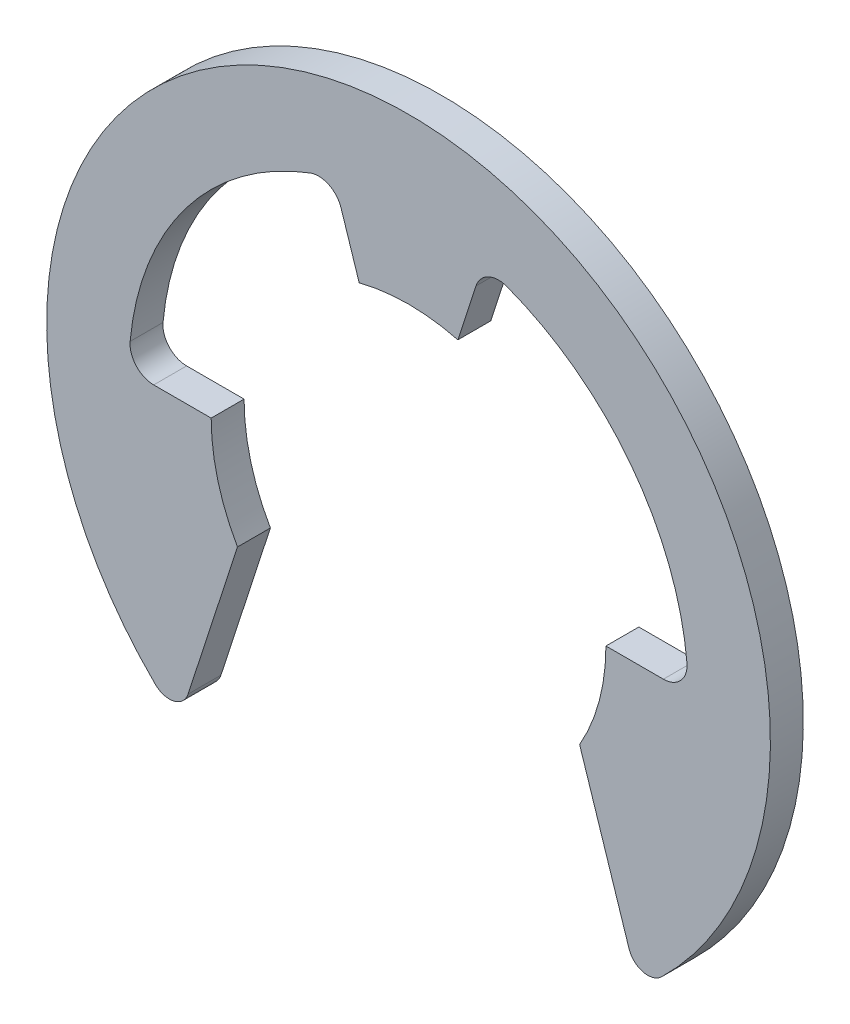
ISO-10303-21;
HEADER;
FILE_DESCRIPTION(('STEP AP214'),'2;1');
FILE_NAME('part.step','',(''),(''),'','','');
FILE_SCHEMA(('AUTOMOTIVE_DESIGN { 1 0 10303 214 1 1 1 1 }'));
ENDSEC;
DATA;
#1=APPLICATION_CONTEXT('core data for automotive mechanical design processes');
#2=APPLICATION_PROTOCOL_DEFINITION('international standard','automotive_design',2000,#1);
#3=PRODUCT_CONTEXT('',#1,'mechanical');
#4=PRODUCT('Part','Part','',(#3));
#5=PRODUCT_RELATED_PRODUCT_CATEGORY('part','',(#4));
#6=PRODUCT_DEFINITION_FORMATION('','',#4);
#7=PRODUCT_DEFINITION_CONTEXT('part definition',#1,'design');
#8=PRODUCT_DEFINITION('design','',#6,#7);
#9=PRODUCT_DEFINITION_SHAPE('','',#8);
#10=(LENGTH_UNIT() NAMED_UNIT(*) SI_UNIT(.MILLI.,.METRE.));
#11=(NAMED_UNIT(*) PLANE_ANGLE_UNIT() SI_UNIT($,.RADIAN.));
#12=(NAMED_UNIT(*) SI_UNIT($,.STERADIAN.) SOLID_ANGLE_UNIT());
#13=UNCERTAINTY_MEASURE_WITH_UNIT(LENGTH_MEASURE(1.E-05),#10,'distance_accuracy_value','');
#14=(GEOMETRIC_REPRESENTATION_CONTEXT(3) GLOBAL_UNCERTAINTY_ASSIGNED_CONTEXT((#13)) GLOBAL_UNIT_ASSIGNED_CONTEXT((#10,
#11,#12)) REPRESENTATION_CONTEXT('',''));
#15=CARTESIAN_POINT('',(0.,0.,0.));
#16=DIRECTION('',(0.,0.,1.));
#17=DIRECTION('',(1.,0.,0.));
#18=AXIS2_PLACEMENT_3D('',#15,#16,#17);
#19=CARTESIAN_POINT('',(-14.5470933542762,-14.8668111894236,2.));
#20=DIRECTION('',(0.,0.,-1.));
#21=DIRECTION('',(-1.,0.,0.));
#22=AXIS2_PLACEMENT_3D('',#19,#20,#21);
#23=CYLINDRICAL_SURFACE('',#22,1.2);
#24=CARTESIAN_POINT('',(-14.5470933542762,-14.8668111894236,0.));
#25=DIRECTION('',(0.,0.,1.));
#26=DIRECTION('',(-1.,0.,0.));
#27=AXIS2_PLACEMENT_3D('',#24,#25,#26);
#28=CIRCLE('',#27,1.2);
#29=CARTESIAN_POINT('',(-15.3863487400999,-15.7245118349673,0.));
#30=VERTEX_POINT('',#29);
#31=CARTESIAN_POINT('',(-13.4058255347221,-15.2376315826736,0.));
#32=VERTEX_POINT('',#31);
#33=EDGE_CURVE('E181',#30,#32,#28,.T.);
#34=ORIENTED_EDGE('',*,*,#33,.T.);
#35=DIRECTION('',(0.,0.,-1.));
#36=VECTOR('',#35,1.);
#37=CARTESIAN_POINT('',(-13.4058255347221,-15.2376315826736,2.));
#38=LINE('',#37,#36);
#39=CARTESIAN_POINT('',(-13.4058255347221,-15.2376315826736,2.));
#40=VERTEX_POINT('',#39);
#41=EDGE_CURVE('E162',#40,#32,#38,.T.);
#42=ORIENTED_EDGE('',*,*,#41,.F.);
#43=CARTESIAN_POINT('',(-14.5470933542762,-14.8668111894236,2.));
#44=DIRECTION('',(0.,0.,1.));
#45=DIRECTION('',(-1.,0.,0.));
#46=AXIS2_PLACEMENT_3D('',#43,#44,#45);
#47=CIRCLE('',#46,1.2);
#48=CARTESIAN_POINT('',(-15.3863487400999,-15.7245118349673,2.));
#49=VERTEX_POINT('',#48);
#50=EDGE_CURVE('E169',#49,#40,#47,.T.);
#51=ORIENTED_EDGE('',*,*,#50,.F.);
#52=DIRECTION('',(0.,0.,-1.));
#53=VECTOR('',#52,1.);
#54=CARTESIAN_POINT('',(-15.3863487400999,-15.7245118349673,2.));
#55=LINE('',#54,#53);
#56=EDGE_CURVE('E268',#49,#30,#55,.T.);
#57=ORIENTED_EDGE('',*,*,#56,.T.);
#58=EDGE_LOOP('',(#34,#42,#51,#57));
#59=FACE_BOUND('',#58,.T.);
#60=ADVANCED_FACE('F33',(#59),#23,.T.);
#61=CARTESIAN_POINT('',(-10.4,-5.98665181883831,2.));
#62=DIRECTION('',(-0.951056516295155,0.309016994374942,0.));
#63=DIRECTION('',(-0.309016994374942,-0.951056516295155,0.));
#64=AXIS2_PLACEMENT_3D('',#61,#62,#63);
#65=PLANE('',#64);
#66=DIRECTION('',(0.309016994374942,0.951056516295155,0.));
#67=VECTOR('',#66,1.);
#68=CARTESIAN_POINT('',(-10.4,-5.98665181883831,0.));
#69=LINE('',#68,#67);
#70=CARTESIAN_POINT('',(-10.4,-5.98665181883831,0.));
#71=VERTEX_POINT('',#70);
#72=EDGE_CURVE('E291',#32,#71,#69,.T.);
#73=ORIENTED_EDGE('',*,*,#72,.T.);
#74=DIRECTION('',(0.,0.,-1.));
#75=VECTOR('',#74,1.);
#76=CARTESIAN_POINT('',(-10.4,-5.98665181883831,2.));
#77=LINE('',#76,#75);
#78=CARTESIAN_POINT('',(-10.4,-5.98665181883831,2.));
#79=VERTEX_POINT('',#78);
#80=EDGE_CURVE('E165',#79,#71,#77,.T.);
#81=ORIENTED_EDGE('',*,*,#80,.F.);
#82=DIRECTION('',(0.309016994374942,0.951056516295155,0.));
#83=VECTOR('',#82,1.);
#84=CARTESIAN_POINT('',(-10.4,-5.98665181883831,2.));
#85=LINE('',#84,#83);
#86=EDGE_CURVE('E158',#40,#79,#85,.T.);
#87=ORIENTED_EDGE('',*,*,#86,.F.);
#88=ORIENTED_EDGE('',*,*,#41,.T.);
#89=EDGE_LOOP('',(#73,#81,#87,#88));
#90=FACE_BOUND('',#89,.T.);
#91=ADVANCED_FACE('F160',(#90),#65,.F.);
#92=CARTESIAN_POINT('',(0.,0.,2.));
#93=DIRECTION('',(0.,0.,-1.));
#94=DIRECTION('',(-1.,0.,0.));
#95=AXIS2_PLACEMENT_3D('',#92,#93,#94);
#96=CYLINDRICAL_SURFACE('',#95,12.);
#97=CARTESIAN_POINT('',(0.,0.,0.));
#98=DIRECTION('',(0.,0.,-1.));
#99=DIRECTION('',(1.,0.,0.));
#100=AXIS2_PLACEMENT_3D('',#97,#98,#99);
#101=CIRCLE('',#100,12.);
#102=CARTESIAN_POINT('',(-12.,0.,0.));
#103=VERTEX_POINT('',#102);
#104=EDGE_CURVE('E248',#71,#103,#101,.T.);
#105=ORIENTED_EDGE('',*,*,#104,.T.);
#106=DIRECTION('',(0.,0.,-1.));
#107=VECTOR('',#106,1.);
#108=CARTESIAN_POINT('',(-12.,0.,2.));
#109=LINE('',#108,#107);
#110=CARTESIAN_POINT('',(-12.,0.,2.));
#111=VERTEX_POINT('',#110);
#112=EDGE_CURVE('E187',#111,#103,#109,.T.);
#113=ORIENTED_EDGE('',*,*,#112,.F.);
#114=CARTESIAN_POINT('',(0.,0.,2.));
#115=DIRECTION('',(0.,0.,-1.));
#116=DIRECTION('',(1.,0.,0.));
#117=AXIS2_PLACEMENT_3D('',#114,#115,#116);
#118=CIRCLE('',#117,12.);
#119=EDGE_CURVE('E168',#79,#111,#118,.T.);
#120=ORIENTED_EDGE('',*,*,#119,.F.);
#121=ORIENTED_EDGE('',*,*,#80,.T.);
#122=EDGE_LOOP('',(#105,#113,#120,#121));
#123=FACE_BOUND('',#122,.T.);
#124=ADVANCED_FACE('F314',(#123),#96,.F.);
#125=CARTESIAN_POINT('',(-12.,0.,2.));
#126=DIRECTION('',(0.,-1.,0.));
#127=DIRECTION('',(0.,0.,-1.));
#128=AXIS2_PLACEMENT_3D('',#125,#126,#127);
#129=PLANE('',#128);
#130=DIRECTION('',(-1.,0.,0.));
#131=VECTOR('',#130,1.);
#132=CARTESIAN_POINT('',(-12.,0.,0.));
#133=LINE('',#132,#131);
#134=CARTESIAN_POINT('',(-15.4932243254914,0.,0.));
#135=VERTEX_POINT('',#134);
#136=EDGE_CURVE('E244',#103,#135,#133,.T.);
#137=ORIENTED_EDGE('',*,*,#136,.T.);
#138=DIRECTION('',(0.,0.,1.));
#139=VECTOR('',#138,1.);
#140=CARTESIAN_POINT('',(-15.4932243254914,0.,2.));
#141=LINE('',#140,#139);
#142=CARTESIAN_POINT('',(-15.4932243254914,0.,2.));
#143=VERTEX_POINT('',#142);
#144=EDGE_CURVE('E48',#135,#143,#141,.T.);
#145=ORIENTED_EDGE('',*,*,#144,.T.);
#146=DIRECTION('',(-1.,0.,0.));
#147=VECTOR('',#146,1.);
#148=CARTESIAN_POINT('',(-12.,0.,2.));
#149=LINE('',#148,#147);
#150=EDGE_CURVE('E288',#111,#143,#149,.T.);
#151=ORIENTED_EDGE('',*,*,#150,.F.);
#152=ORIENTED_EDGE('',*,*,#112,.T.);
#153=EDGE_LOOP('',(#137,#145,#151,#152));
#154=FACE_BOUND('',#153,.T.);
#155=ADVANCED_FACE('F287',(#154),#129,.F.);
#156=CARTESIAN_POINT('',(0.,0.,2.));
#157=DIRECTION('',(0.,0.,-1.));
#158=DIRECTION('',(-1.,0.,0.));
#159=AXIS2_PLACEMENT_3D('',#156,#157,#158);
#160=CYLINDRICAL_SURFACE('',#159,17.);
#161=CARTESIAN_POINT('',(0.,0.,0.));
#162=DIRECTION('',(0.,0.,-1.));
#163=DIRECTION('',(1.,0.,0.));
#164=AXIS2_PLACEMENT_3D('',#161,#162,#163);
#165=CIRCLE('',#164,17.);
#166=CARTESIAN_POINT('',(-16.9270445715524,1.573264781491,0.));
#167=VERTEX_POINT('',#166);
#168=CARTESIAN_POINT('',(-5.97810200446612,15.9142168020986,0.));
#169=VERTEX_POINT('',#168);
#170=EDGE_CURVE('E238',#167,#169,#165,.T.);
#171=ORIENTED_EDGE('',*,*,#170,.T.);
#172=DIRECTION('',(0.,0.,-1.));
#173=VECTOR('',#172,1.);
#174=CARTESIAN_POINT('',(-5.97810200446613,15.9142168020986,2.));
#175=LINE('',#174,#173);
#176=CARTESIAN_POINT('',(-5.97810200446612,15.9142168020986,2.));
#177=VERTEX_POINT('',#176);
#178=EDGE_CURVE('E203',#169,#177,#175,.F.);
#179=ORIENTED_EDGE('',*,*,#178,.T.);
#180=CARTESIAN_POINT('',(0.,0.,2.));
#181=DIRECTION('',(0.,0.,-1.));
#182=DIRECTION('',(1.,0.,0.));
#183=AXIS2_PLACEMENT_3D('',#180,#181,#182);
#184=CIRCLE('',#183,17.);
#185=CARTESIAN_POINT('',(-16.9270445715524,1.573264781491,2.));
#186=VERTEX_POINT('',#185);
#187=EDGE_CURVE('E223',#186,#177,#184,.T.);
#188=ORIENTED_EDGE('',*,*,#187,.F.);
#189=DIRECTION('',(0.,0.,-1.));
#190=VECTOR('',#189,1.);
#191=CARTESIAN_POINT('',(-16.9270445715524,1.573264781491,2.));
#192=LINE('',#191,#190);
#193=EDGE_CURVE('E200',#186,#167,#192,.T.);
#194=ORIENTED_EDGE('',*,*,#193,.T.);
#195=EDGE_LOOP('',(#171,#179,#188,#194));
#196=FACE_BOUND('',#195,.T.);
#197=ADVANCED_FACE('F242',(#196),#160,.F.);
#198=CARTESIAN_POINT('',(-3.,11.6189500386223,2.));
#199=DIRECTION('',(0.951056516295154,0.309016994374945,0.));
#200=DIRECTION('',(-0.309016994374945,0.951056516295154,0.));
#201=AXIS2_PLACEMENT_3D('',#198,#199,#200);
#202=PLANE('',#201);
#203=DIRECTION('',(0.309016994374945,-0.951056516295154,0.));
#204=VECTOR('',#203,1.);
#205=CARTESIAN_POINT('',(-3.,11.6189500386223,2.));
#206=LINE('',#205,#204);
#207=CARTESIAN_POINT('',(-4.10220021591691,15.0111734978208,2.));
#208=VERTEX_POINT('',#207);
#209=CARTESIAN_POINT('',(-3.,11.6189500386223,2.));
#210=VERTEX_POINT('',#209);
#211=EDGE_CURVE('E220',#208,#210,#206,.T.);
#212=ORIENTED_EDGE('',*,*,#211,.F.);
#213=DIRECTION('',(0.,0.,1.));
#214=VECTOR('',#213,1.);
#215=CARTESIAN_POINT('',(-4.10220021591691,15.0111734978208,0.));
#216=LINE('',#215,#214);
#217=CARTESIAN_POINT('',(-4.10220021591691,15.0111734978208,0.));
#218=VERTEX_POINT('',#217);
#219=EDGE_CURVE('E197',#208,#218,#216,.F.);
#220=ORIENTED_EDGE('',*,*,#219,.T.);
#221=DIRECTION('',(0.309016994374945,-0.951056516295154,0.));
#222=VECTOR('',#221,1.);
#223=CARTESIAN_POINT('',(-3.,11.6189500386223,0.));
#224=LINE('',#223,#222);
#225=CARTESIAN_POINT('',(-3.,11.6189500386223,0.));
#226=VERTEX_POINT('',#225);
#227=EDGE_CURVE('E240',#218,#226,#224,.T.);
#228=ORIENTED_EDGE('',*,*,#227,.T.);
#229=DIRECTION('',(0.,0.,-1.));
#230=VECTOR('',#229,1.);
#231=CARTESIAN_POINT('',(-3.,11.6189500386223,2.));
#232=LINE('',#231,#230);
#233=EDGE_CURVE('E231',#210,#226,#232,.T.);
#234=ORIENTED_EDGE('',*,*,#233,.F.);
#235=EDGE_LOOP('',(#212,#220,#228,#234));
#236=FACE_BOUND('',#235,.T.);
#237=ADVANCED_FACE('F228',(#236),#202,.F.);
#238=CARTESIAN_POINT('',(0.,0.,2.));
#239=DIRECTION('',(0.,0.,-1.));
#240=DIRECTION('',(-1.,0.,0.));
#241=AXIS2_PLACEMENT_3D('',#238,#239,#240);
#242=CYLINDRICAL_SURFACE('',#241,12.);
#243=CARTESIAN_POINT('',(0.,0.,0.));
#244=DIRECTION('',(0.,0.,-1.));
#245=DIRECTION('',(1.,0.,0.));
#246=AXIS2_PLACEMENT_3D('',#243,#244,#245);
#247=CIRCLE('',#246,12.);
#248=CARTESIAN_POINT('',(3.,11.6189500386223,0.));
#249=VERTEX_POINT('',#248);
#250=EDGE_CURVE('E246',#226,#249,#247,.T.);
#251=ORIENTED_EDGE('',*,*,#250,.T.);
#252=DIRECTION('',(0.,0.,-1.));
#253=VECTOR('',#252,1.);
#254=CARTESIAN_POINT('',(3.,11.6189500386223,2.));
#255=LINE('',#254,#253);
#256=CARTESIAN_POINT('',(3.,11.6189500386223,2.));
#257=VERTEX_POINT('',#256);
#258=EDGE_CURVE('E282',#257,#249,#255,.T.);
#259=ORIENTED_EDGE('',*,*,#258,.F.);
#260=CARTESIAN_POINT('',(0.,0.,2.));
#261=DIRECTION('',(0.,0.,-1.));
#262=DIRECTION('',(1.,0.,0.));
#263=AXIS2_PLACEMENT_3D('',#260,#261,#262);
#264=CIRCLE('',#263,12.);
#265=EDGE_CURVE('E233',#210,#257,#264,.T.);
#266=ORIENTED_EDGE('',*,*,#265,.F.);
#267=ORIENTED_EDGE('',*,*,#233,.T.);
#268=EDGE_LOOP('',(#251,#259,#266,#267));
#269=FACE_BOUND('',#268,.T.);
#270=ADVANCED_FACE('F410',(#269),#242,.F.);
#271=CARTESIAN_POINT('',(3.,11.6189500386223,2.));
#272=DIRECTION('',(-0.951056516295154,0.309016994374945,0.));
#273=DIRECTION('',(-0.309016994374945,-0.951056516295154,0.));
#274=AXIS2_PLACEMENT_3D('',#271,#272,#273);
#275=PLANE('',#274);
#276=DIRECTION('',(0.309016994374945,0.951056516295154,0.));
#277=VECTOR('',#276,1.);
#278=CARTESIAN_POINT('',(3.,11.6189500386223,0.));
#279=LINE('',#278,#277);
#280=CARTESIAN_POINT('',(4.10220021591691,15.0111734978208,0.));
#281=VERTEX_POINT('',#280);
#282=EDGE_CURVE('E253',#249,#281,#279,.T.);
#283=ORIENTED_EDGE('',*,*,#282,.T.);
#284=DIRECTION('',(0.,0.,1.));
#285=VECTOR('',#284,1.);
#286=CARTESIAN_POINT('',(4.10220021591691,15.0111734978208,2.));
#287=LINE('',#286,#285);
#288=CARTESIAN_POINT('',(4.10220021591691,15.0111734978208,2.));
#289=VERTEX_POINT('',#288);
#290=EDGE_CURVE('E195',#281,#289,#287,.T.);
#291=ORIENTED_EDGE('',*,*,#290,.T.);
#292=DIRECTION('',(0.309016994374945,0.951056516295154,0.));
#293=VECTOR('',#292,1.);
#294=CARTESIAN_POINT('',(3.,11.6189500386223,2.));
#295=LINE('',#294,#293);
#296=EDGE_CURVE('E307',#257,#289,#295,.T.);
#297=ORIENTED_EDGE('',*,*,#296,.F.);
#298=ORIENTED_EDGE('',*,*,#258,.T.);
#299=EDGE_LOOP('',(#283,#291,#297,#298));
#300=FACE_BOUND('',#299,.T.);
#301=ADVANCED_FACE('F400',(#300),#275,.F.);
#302=CARTESIAN_POINT('',(0.,0.,2.));
#303=DIRECTION('',(0.,0.,-1.));
#304=DIRECTION('',(-1.,0.,0.));
#305=AXIS2_PLACEMENT_3D('',#302,#303,#304);
#306=CYLINDRICAL_SURFACE('',#305,17.);
#307=CARTESIAN_POINT('',(0.,0.,0.));
#308=DIRECTION('',(0.,0.,-1.));
#309=DIRECTION('',(1.,0.,0.));
#310=AXIS2_PLACEMENT_3D('',#307,#308,#309);
#311=CIRCLE('',#310,17.);
#312=CARTESIAN_POINT('',(5.97810200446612,15.9142168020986,0.));
#313=VERTEX_POINT('',#312);
#314=CARTESIAN_POINT('',(16.9270445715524,1.573264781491,0.));
#315=VERTEX_POINT('',#314);
#316=EDGE_CURVE('E256',#313,#315,#311,.T.);
#317=ORIENTED_EDGE('',*,*,#316,.T.);
#318=DIRECTION('',(0.,0.,-1.));
#319=VECTOR('',#318,1.);
#320=CARTESIAN_POINT('',(16.9270445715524,1.573264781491,2.));
#321=LINE('',#320,#319);
#322=CARTESIAN_POINT('',(16.9270445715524,1.573264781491,2.));
#323=VERTEX_POINT('',#322);
#324=EDGE_CURVE('E193',#315,#323,#321,.F.);
#325=ORIENTED_EDGE('',*,*,#324,.T.);
#326=CARTESIAN_POINT('',(0.,0.,2.));
#327=DIRECTION('',(0.,0.,-1.));
#328=DIRECTION('',(1.,0.,0.));
#329=AXIS2_PLACEMENT_3D('',#326,#327,#328);
#330=CIRCLE('',#329,17.);
#331=CARTESIAN_POINT('',(5.97810200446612,15.9142168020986,2.));
#332=VERTEX_POINT('',#331);
#333=EDGE_CURVE('E304',#332,#323,#330,.T.);
#334=ORIENTED_EDGE('',*,*,#333,.F.);
#335=DIRECTION('',(0.,0.,-1.));
#336=VECTOR('',#335,1.);
#337=CARTESIAN_POINT('',(5.97810200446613,15.9142168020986,2.));
#338=LINE('',#337,#336);
#339=EDGE_CURVE('E185',#332,#313,#338,.T.);
#340=ORIENTED_EDGE('',*,*,#339,.T.);
#341=EDGE_LOOP('',(#317,#325,#334,#340));
#342=FACE_BOUND('',#341,.T.);
#343=ADVANCED_FACE('F388',(#342),#306,.F.);
#344=CARTESIAN_POINT('',(12.,0.,2.));
#345=DIRECTION('',(0.,-1.,0.));
#346=DIRECTION('',(0.,0.,-1.));
#347=AXIS2_PLACEMENT_3D('',#344,#345,#346);
#348=PLANE('',#347);
#349=DIRECTION('',(-1.,0.,0.));
#350=VECTOR('',#349,1.);
#351=CARTESIAN_POINT('',(12.,0.,2.));
#352=LINE('',#351,#350);
#353=CARTESIAN_POINT('',(15.4932243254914,0.,2.));
#354=VERTEX_POINT('',#353);
#355=CARTESIAN_POINT('',(12.,0.,2.));
#356=VERTEX_POINT('',#355);
#357=EDGE_CURVE('E302',#354,#356,#352,.T.);
#358=ORIENTED_EDGE('',*,*,#357,.F.);
#359=DIRECTION('',(0.,0.,1.));
#360=VECTOR('',#359,1.);
#361=CARTESIAN_POINT('',(15.4932243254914,0.,0.));
#362=LINE('',#361,#360);
#363=CARTESIAN_POINT('',(15.4932243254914,0.,0.));
#364=VERTEX_POINT('',#363);
#365=EDGE_CURVE('E182',#354,#364,#362,.F.);
#366=ORIENTED_EDGE('',*,*,#365,.T.);
#367=DIRECTION('',(-1.,0.,0.));
#368=VECTOR('',#367,1.);
#369=CARTESIAN_POINT('',(12.,0.,0.));
#370=LINE('',#369,#368);
#371=CARTESIAN_POINT('',(12.,0.,0.));
#372=VERTEX_POINT('',#371);
#373=EDGE_CURVE('E259',#364,#372,#370,.T.);
#374=ORIENTED_EDGE('',*,*,#373,.T.);
#375=DIRECTION('',(0.,0.,-1.));
#376=VECTOR('',#375,1.);
#377=CARTESIAN_POINT('',(12.,0.,2.));
#378=LINE('',#377,#376);
#379=EDGE_CURVE('E279',#356,#372,#378,.T.);
#380=ORIENTED_EDGE('',*,*,#379,.F.);
#381=EDGE_LOOP('',(#358,#366,#374,#380));
#382=FACE_BOUND('',#381,.T.);
#383=ADVANCED_FACE('F382',(#382),#348,.F.);
#384=CARTESIAN_POINT('',(0.,0.,2.));
#385=DIRECTION('',(0.,0.,-1.));
#386=DIRECTION('',(-1.,0.,0.));
#387=AXIS2_PLACEMENT_3D('',#384,#385,#386);
#388=CYLINDRICAL_SURFACE('',#387,12.);
#389=CARTESIAN_POINT('',(0.,0.,0.));
#390=DIRECTION('',(0.,0.,-1.));
#391=DIRECTION('',(1.,0.,0.));
#392=AXIS2_PLACEMENT_3D('',#389,#390,#391);
#393=CIRCLE('',#392,12.);
#394=CARTESIAN_POINT('',(10.4,-5.98665181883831,0.));
#395=VERTEX_POINT('',#394);
#396=EDGE_CURVE('E261',#372,#395,#393,.T.);
#397=ORIENTED_EDGE('',*,*,#396,.T.);
#398=DIRECTION('',(0.,0.,-1.));
#399=VECTOR('',#398,1.);
#400=CARTESIAN_POINT('',(10.4,-5.98665181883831,2.));
#401=LINE('',#400,#399);
#402=CARTESIAN_POINT('',(10.4,-5.98665181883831,2.));
#403=VERTEX_POINT('',#402);
#404=EDGE_CURVE('E276',#403,#395,#401,.T.);
#405=ORIENTED_EDGE('',*,*,#404,.F.);
#406=CARTESIAN_POINT('',(0.,0.,2.));
#407=DIRECTION('',(0.,0.,-1.));
#408=DIRECTION('',(1.,0.,0.));
#409=AXIS2_PLACEMENT_3D('',#406,#407,#408);
#410=CIRCLE('',#409,12.);
#411=EDGE_CURVE('E300',#356,#403,#410,.T.);
#412=ORIENTED_EDGE('',*,*,#411,.F.);
#413=ORIENTED_EDGE('',*,*,#379,.T.);
#414=EDGE_LOOP('',(#397,#405,#412,#413));
#415=FACE_BOUND('',#414,.T.);
#416=ADVANCED_FACE('F387',(#415),#388,.F.);
#417=CARTESIAN_POINT('',(10.4,-5.98665181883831,2.));
#418=DIRECTION('',(0.951056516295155,0.309016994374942,0.));
#419=DIRECTION('',(-0.309016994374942,0.951056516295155,0.));
#420=AXIS2_PLACEMENT_3D('',#417,#418,#419);
#421=PLANE('',#420);
#422=DIRECTION('',(0.309016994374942,-0.951056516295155,0.));
#423=VECTOR('',#422,1.);
#424=CARTESIAN_POINT('',(10.4,-5.98665181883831,0.));
#425=LINE('',#424,#423);
#426=CARTESIAN_POINT('',(13.4058255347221,-15.2376315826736,0.));
#427=VERTEX_POINT('',#426);
#428=EDGE_CURVE('E263',#395,#427,#425,.T.);
#429=ORIENTED_EDGE('',*,*,#428,.T.);
#430=DIRECTION('',(0.,0.,-1.));
#431=VECTOR('',#430,1.);
#432=CARTESIAN_POINT('',(13.4058255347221,-15.2376315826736,2.));
#433=LINE('',#432,#431);
#434=CARTESIAN_POINT('',(13.4058255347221,-15.2376315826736,2.));
#435=VERTEX_POINT('',#434);
#436=EDGE_CURVE('E273',#435,#427,#433,.T.);
#437=ORIENTED_EDGE('',*,*,#436,.F.);
#438=DIRECTION('',(0.309016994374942,-0.951056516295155,0.));
#439=VECTOR('',#438,1.);
#440=CARTESIAN_POINT('',(10.4,-5.98665181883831,2.));
#441=LINE('',#440,#439);
#442=EDGE_CURVE('E298',#403,#435,#441,.T.);
#443=ORIENTED_EDGE('',*,*,#442,.F.);
#444=ORIENTED_EDGE('',*,*,#404,.T.);
#445=EDGE_LOOP('',(#429,#437,#443,#444));
#446=FACE_BOUND('',#445,.T.);
#447=ADVANCED_FACE('F453',(#446),#421,.F.);
#448=CARTESIAN_POINT('',(14.5470933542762,-14.8668111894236,2.));
#449=DIRECTION('',(0.,0.,-1.));
#450=DIRECTION('',(-1.,0.,0.));
#451=AXIS2_PLACEMENT_3D('',#448,#449,#450);
#452=CYLINDRICAL_SURFACE('',#451,1.2);
#453=CARTESIAN_POINT('',(14.5470933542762,-14.8668111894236,0.));
#454=DIRECTION('',(0.,0.,1.));
#455=DIRECTION('',(-1.,0.,0.));
#456=AXIS2_PLACEMENT_3D('',#453,#454,#455);
#457=CIRCLE('',#456,1.2);
#458=CARTESIAN_POINT('',(15.3863487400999,-15.7245118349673,0.));
#459=VERTEX_POINT('',#458);
#460=EDGE_CURVE('E265',#427,#459,#457,.T.);
#461=ORIENTED_EDGE('',*,*,#460,.T.);
#462=DIRECTION('',(0.,0.,-1.));
#463=VECTOR('',#462,1.);
#464=CARTESIAN_POINT('',(15.3863487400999,-15.7245118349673,2.));
#465=LINE('',#464,#463);
#466=CARTESIAN_POINT('',(15.3863487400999,-15.7245118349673,2.));
#467=VERTEX_POINT('',#466);
#468=EDGE_CURVE('E270',#467,#459,#465,.T.);
#469=ORIENTED_EDGE('',*,*,#468,.F.);
#470=CARTESIAN_POINT('',(14.5470933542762,-14.8668111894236,2.));
#471=DIRECTION('',(0.,0.,1.));
#472=DIRECTION('',(-1.,0.,0.));
#473=AXIS2_PLACEMENT_3D('',#470,#471,#472);
#474=CIRCLE('',#473,1.2);
#475=EDGE_CURVE('E296',#435,#467,#474,.T.);
#476=ORIENTED_EDGE('',*,*,#475,.F.);
#477=ORIENTED_EDGE('',*,*,#436,.T.);
#478=EDGE_LOOP('',(#461,#469,#476,#477));
#479=FACE_BOUND('',#478,.T.);
#480=ADVANCED_FACE('F443',(#479),#452,.T.);
#481=CARTESIAN_POINT('',(0.,0.,2.));
#482=DIRECTION('',(0.,0.,-1.));
#483=DIRECTION('',(-1.,0.,0.));
#484=AXIS2_PLACEMENT_3D('',#481,#482,#483);
#485=CYLINDRICAL_SURFACE('',#484,22.);
#486=CARTESIAN_POINT('',(0.,0.,0.));
#487=DIRECTION('',(0.,0.,1.));
#488=DIRECTION('',(1.,0.,0.));
#489=AXIS2_PLACEMENT_3D('',#486,#487,#488);
#490=CIRCLE('',#489,22.);
#491=EDGE_CURVE('E178',#459,#30,#490,.T.);
#492=ORIENTED_EDGE('',*,*,#491,.T.);
#493=ORIENTED_EDGE('',*,*,#56,.F.);
#494=CARTESIAN_POINT('',(0.,0.,2.));
#495=DIRECTION('',(0.,0.,1.));
#496=DIRECTION('',(1.,0.,0.));
#497=AXIS2_PLACEMENT_3D('',#494,#495,#496);
#498=CIRCLE('',#497,22.);
#499=EDGE_CURVE('E174',#467,#49,#498,.T.);
#500=ORIENTED_EDGE('',*,*,#499,.F.);
#501=ORIENTED_EDGE('',*,*,#468,.T.);
#502=EDGE_LOOP('',(#492,#493,#500,#501));
#503=FACE_BOUND('',#502,.T.);
#504=ADVANCED_FACE('F375',(#503),#485,.T.);
#505=CARTESIAN_POINT('',(-14.5470933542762,-14.8668111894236,2.));
#506=DIRECTION('',(0.,0.,-1.));
#507=DIRECTION('',(-1.,0.,0.));
#508=AXIS2_PLACEMENT_3D('',#505,#506,#507);
#509=PLANE('',#508);
#510=ORIENTED_EDGE('',*,*,#50,.T.);
#511=ORIENTED_EDGE('',*,*,#86,.T.);
#512=ORIENTED_EDGE('',*,*,#119,.T.);
#513=ORIENTED_EDGE('',*,*,#150,.T.);
#514=CARTESIAN_POINT('',(-15.4932243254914,1.44,2.));
#515=DIRECTION('',(0.,0.,-1.));
#516=DIRECTION('',(-1.,0.,0.));
#517=AXIS2_PLACEMENT_3D('',#514,#515,#516);
#518=CIRCLE('',#517,1.44);
#519=EDGE_CURVE('E11',#143,#186,#518,.T.);
#520=ORIENTED_EDGE('',*,*,#519,.T.);
#521=ORIENTED_EDGE('',*,*,#187,.T.);
#522=CARTESIAN_POINT('',(-5.47172159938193,14.5661890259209,2.));
#523=DIRECTION('',(0.,0.,-1.));
#524=DIRECTION('',(-1.,0.,0.));
#525=AXIS2_PLACEMENT_3D('',#522,#523,#524);
#526=CIRCLE('',#525,1.44);
#527=EDGE_CURVE('E216',#177,#208,#526,.T.);
#528=ORIENTED_EDGE('',*,*,#527,.T.);
#529=ORIENTED_EDGE('',*,*,#211,.T.);
#530=ORIENTED_EDGE('',*,*,#265,.T.);
#531=ORIENTED_EDGE('',*,*,#296,.T.);
#532=CARTESIAN_POINT('',(5.47172159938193,14.5661890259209,2.));
#533=DIRECTION('',(0.,0.,-1.));
#534=DIRECTION('',(-1.,0.,0.));
#535=AXIS2_PLACEMENT_3D('',#532,#533,#534);
#536=CIRCLE('',#535,1.44);
#537=EDGE_CURVE('E212',#289,#332,#536,.T.);
#538=ORIENTED_EDGE('',*,*,#537,.T.);
#539=ORIENTED_EDGE('',*,*,#333,.T.);
#540=CARTESIAN_POINT('',(15.4932243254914,1.44,2.));
#541=DIRECTION('',(0.,0.,-1.));
#542=DIRECTION('',(-1.,0.,0.));
#543=AXIS2_PLACEMENT_3D('',#540,#541,#542);
#544=CIRCLE('',#543,1.44);
#545=EDGE_CURVE('E208',#323,#354,#544,.T.);
#546=ORIENTED_EDGE('',*,*,#545,.T.);
#547=ORIENTED_EDGE('',*,*,#357,.T.);
#548=ORIENTED_EDGE('',*,*,#411,.T.);
#549=ORIENTED_EDGE('',*,*,#442,.T.);
#550=ORIENTED_EDGE('',*,*,#475,.T.);
#551=ORIENTED_EDGE('',*,*,#499,.T.);
#552=EDGE_LOOP('',(#510,#511,#512,#513,#520,#521,#528,#529,#530,#531,#538,#539,#546,#547,#548,
#549,#550,#551));
#553=FACE_BOUND('',#552,.T.);
#554=ADVANCED_FACE('F172',(#553),#509,.F.);
#555=CARTESIAN_POINT('',(-14.5470933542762,-14.8668111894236,0.));
#556=DIRECTION('',(0.,0.,-1.));
#557=DIRECTION('',(-1.,0.,0.));
#558=AXIS2_PLACEMENT_3D('',#555,#556,#557);
#559=PLANE('',#558);
#560=ORIENTED_EDGE('',*,*,#33,.F.);
#561=ORIENTED_EDGE('',*,*,#491,.F.);
#562=ORIENTED_EDGE('',*,*,#460,.F.);
#563=ORIENTED_EDGE('',*,*,#428,.F.);
#564=ORIENTED_EDGE('',*,*,#396,.F.);
#565=ORIENTED_EDGE('',*,*,#373,.F.);
#566=CARTESIAN_POINT('',(15.4932243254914,1.44,0.));
#567=DIRECTION('',(0.,0.,-1.));
#568=DIRECTION('',(-1.,0.,0.));
#569=AXIS2_PLACEMENT_3D('',#566,#567,#568);
#570=CIRCLE('',#569,1.44);
#571=EDGE_CURVE('E206',#364,#315,#570,.F.);
#572=ORIENTED_EDGE('',*,*,#571,.T.);
#573=ORIENTED_EDGE('',*,*,#316,.F.);
#574=CARTESIAN_POINT('',(5.47172159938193,14.5661890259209,0.));
#575=DIRECTION('',(0.,0.,-1.));
#576=DIRECTION('',(-1.,0.,0.));
#577=AXIS2_PLACEMENT_3D('',#574,#575,#576);
#578=CIRCLE('',#577,1.44);
#579=EDGE_CURVE('E210',#313,#281,#578,.F.);
#580=ORIENTED_EDGE('',*,*,#579,.T.);
#581=ORIENTED_EDGE('',*,*,#282,.F.);
#582=ORIENTED_EDGE('',*,*,#250,.F.);
#583=ORIENTED_EDGE('',*,*,#227,.F.);
#584=CARTESIAN_POINT('',(-5.47172159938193,14.5661890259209,0.));
#585=DIRECTION('',(0.,0.,-1.));
#586=DIRECTION('',(-1.,0.,0.));
#587=AXIS2_PLACEMENT_3D('',#584,#585,#586);
#588=CIRCLE('',#587,1.44);
#589=EDGE_CURVE('E214',#218,#169,#588,.F.);
#590=ORIENTED_EDGE('',*,*,#589,.T.);
#591=ORIENTED_EDGE('',*,*,#170,.F.);
#592=CARTESIAN_POINT('',(-15.4932243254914,1.44,0.));
#593=DIRECTION('',(0.,0.,-1.));
#594=DIRECTION('',(-1.,0.,0.));
#595=AXIS2_PLACEMENT_3D('',#592,#593,#594);
#596=CIRCLE('',#595,1.44);
#597=EDGE_CURVE('E41',#167,#135,#596,.F.);
#598=ORIENTED_EDGE('',*,*,#597,.T.);
#599=ORIENTED_EDGE('',*,*,#136,.F.);
#600=ORIENTED_EDGE('',*,*,#104,.F.);
#601=ORIENTED_EDGE('',*,*,#72,.F.);
#602=EDGE_LOOP('',(#560,#561,#562,#563,#564,#565,#572,#573,#580,#581,#582,#583,#590,#591,#598,
#599,#600,#601));
#603=FACE_BOUND('',#602,.T.);
#604=ADVANCED_FACE('F237',(#603),#559,.T.);
#605=CARTESIAN_POINT('',(15.4932243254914,1.44,2.));
#606=DIRECTION('',(0.,0.,-1.));
#607=DIRECTION('',(-1.,0.,0.));
#608=AXIS2_PLACEMENT_3D('',#605,#606,#607);
#609=CYLINDRICAL_SURFACE('',#608,1.44);
#610=ORIENTED_EDGE('',*,*,#545,.F.);
#611=ORIENTED_EDGE('',*,*,#324,.F.);
#612=ORIENTED_EDGE('',*,*,#571,.F.);
#613=ORIENTED_EDGE('',*,*,#365,.F.);
#614=EDGE_LOOP('',(#610,#611,#612,#613));
#615=FACE_BOUND('',#614,.T.);
#616=ADVANCED_FACE('F328',(#615),#609,.F.);
#617=CARTESIAN_POINT('',(5.47172159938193,14.5661890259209,2.));
#618=DIRECTION('',(0.,0.,-1.));
#619=DIRECTION('',(-1.,0.,0.));
#620=AXIS2_PLACEMENT_3D('',#617,#618,#619);
#621=CYLINDRICAL_SURFACE('',#620,1.44);
#622=ORIENTED_EDGE('',*,*,#537,.F.);
#623=ORIENTED_EDGE('',*,*,#290,.F.);
#624=ORIENTED_EDGE('',*,*,#579,.F.);
#625=ORIENTED_EDGE('',*,*,#339,.F.);
#626=EDGE_LOOP('',(#622,#623,#624,#625));
#627=FACE_BOUND('',#626,.T.);
#628=ADVANCED_FACE('F331',(#627),#621,.F.);
#629=CARTESIAN_POINT('',(-5.47172159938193,14.5661890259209,2.));
#630=DIRECTION('',(0.,0.,-1.));
#631=DIRECTION('',(-1.,0.,0.));
#632=AXIS2_PLACEMENT_3D('',#629,#630,#631);
#633=CYLINDRICAL_SURFACE('',#632,1.44);
#634=ORIENTED_EDGE('',*,*,#527,.F.);
#635=ORIENTED_EDGE('',*,*,#178,.F.);
#636=ORIENTED_EDGE('',*,*,#589,.F.);
#637=ORIENTED_EDGE('',*,*,#219,.F.);
#638=EDGE_LOOP('',(#634,#635,#636,#637));
#639=FACE_BOUND('',#638,.T.);
#640=ADVANCED_FACE('F235',(#639),#633,.F.);
#641=CARTESIAN_POINT('',(-15.4932243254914,1.44,2.));
#642=DIRECTION('',(0.,0.,-1.));
#643=DIRECTION('',(-1.,0.,0.));
#644=AXIS2_PLACEMENT_3D('',#641,#642,#643);
#645=CYLINDRICAL_SURFACE('',#644,1.44);
#646=ORIENTED_EDGE('',*,*,#519,.F.);
#647=ORIENTED_EDGE('',*,*,#144,.F.);
#648=ORIENTED_EDGE('',*,*,#597,.F.);
#649=ORIENTED_EDGE('',*,*,#193,.F.);
#650=EDGE_LOOP('',(#646,#647,#648,#649));
#651=FACE_BOUND('',#650,.T.);
#652=ADVANCED_FACE('F35',(#651),#645,.F.);
#653=CLOSED_SHELL('',(#60,#91,#124,#155,#197,#237,#270,#301,#343,#383,#416,#447,#480,#504,#554,
#604,#616,#628,#640,#652));
#654=MANIFOLD_SOLID_BREP('B2',#653);
#655=ADVANCED_BREP_SHAPE_REPRESENTATION('',(#18,#654),#14);
#656=SHAPE_DEFINITION_REPRESENTATION(#9,#655);
ENDSEC;
END-ISO-10303-21;
